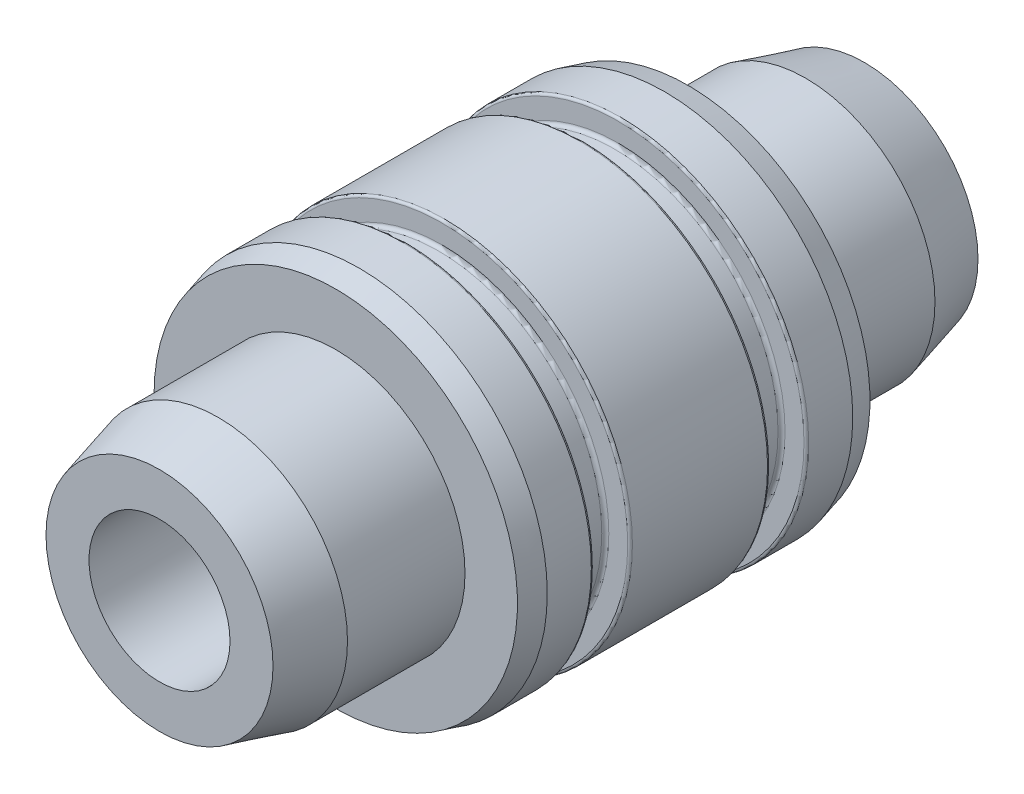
ISO-10303-21;
HEADER;
FILE_DESCRIPTION(('STEP AP214'),'2;1');
FILE_NAME('part.step','',(''),(''),'','','');
FILE_SCHEMA(('AUTOMOTIVE_DESIGN { 1 0 10303 214 1 1 1 1 }'));
ENDSEC;
DATA;
#1=APPLICATION_CONTEXT('core data for automotive mechanical design processes');
#2=APPLICATION_PROTOCOL_DEFINITION('international standard','automotive_design',2000,#1);
#3=PRODUCT_CONTEXT('',#1,'mechanical');
#4=PRODUCT('Part','Part','',(#3));
#5=PRODUCT_RELATED_PRODUCT_CATEGORY('part','',(#4));
#6=PRODUCT_DEFINITION_FORMATION('','',#4);
#7=PRODUCT_DEFINITION_CONTEXT('part definition',#1,'design');
#8=PRODUCT_DEFINITION('design','',#6,#7);
#9=PRODUCT_DEFINITION_SHAPE('','',#8);
#10=(LENGTH_UNIT() NAMED_UNIT(*) SI_UNIT(.MILLI.,.METRE.));
#11=(NAMED_UNIT(*) PLANE_ANGLE_UNIT() SI_UNIT($,.RADIAN.));
#12=(NAMED_UNIT(*) SI_UNIT($,.STERADIAN.) SOLID_ANGLE_UNIT());
#13=UNCERTAINTY_MEASURE_WITH_UNIT(LENGTH_MEASURE(1.E-05),#10,'distance_accuracy_value','');
#14=(GEOMETRIC_REPRESENTATION_CONTEXT(3) GLOBAL_UNCERTAINTY_ASSIGNED_CONTEXT((#13)) GLOBAL_UNIT_ASSIGNED_CONTEXT((#10,
#11,#12)) REPRESENTATION_CONTEXT('',''));
#15=CARTESIAN_POINT('',(0.,0.,0.));
#16=DIRECTION('',(0.,0.,1.));
#17=DIRECTION('',(1.,0.,0.));
#18=AXIS2_PLACEMENT_3D('',#15,#16,#17);
#19=CARTESIAN_POINT('',(0.,0.,15.));
#20=DIRECTION('',(0.,0.,-1.));
#21=DIRECTION('',(-1.,0.,0.));
#22=AXIS2_PLACEMENT_3D('',#19,#20,#21);
#23=CYLINDRICAL_SURFACE('',#22,16.);
#24=CARTESIAN_POINT('',(0.,0.,-5.75));
#25=DIRECTION('',(0.,0.,-1.));
#26=DIRECTION('',(-1.,0.,0.));
#27=AXIS2_PLACEMENT_3D('',#24,#25,#26);
#28=CIRCLE('',#27,16.);
#29=CARTESIAN_POINT('',(-16.,0.,-5.75));
#30=VERTEX_POINT('',#29);
#31=EDGE_CURVE('E46',#30,#30,#28,.F.);
#32=ORIENTED_EDGE('',*,*,#31,.T.);
#33=EDGE_LOOP('',(#32));
#34=FACE_BOUND('',#33,.T.);
#35=CARTESIAN_POINT('',(0.,0.,5.75));
#36=DIRECTION('',(0.,0.,1.));
#37=DIRECTION('',(1.,0.,0.));
#38=AXIS2_PLACEMENT_3D('',#35,#36,#37);
#39=CIRCLE('',#38,16.);
#40=CARTESIAN_POINT('',(16.,0.,5.75));
#41=VERTEX_POINT('',#40);
#42=EDGE_CURVE('E65',#41,#41,#39,.F.);
#43=ORIENTED_EDGE('',*,*,#42,.T.);
#44=EDGE_LOOP('',(#43));
#45=FACE_BOUND('',#44,.T.);
#46=ADVANCED_FACE('F39',(#34,#45),#23,.T.);
#47=CARTESIAN_POINT('',(0.,0.,-9.25));
#48=DIRECTION('',(0.,0.,1.));
#49=DIRECTION('',(1.,0.,0.));
#50=AXIS2_PLACEMENT_3D('',#47,#48,#49);
#51=CIRCLE('',#50,16.);
#52=CARTESIAN_POINT('',(16.,0.,-9.25));
#53=VERTEX_POINT('',#52);
#54=EDGE_CURVE('E50',#53,#53,#51,.F.);
#55=ORIENTED_EDGE('',*,*,#54,.T.);
#56=EDGE_LOOP('',(#55));
#57=FACE_BOUND('',#56,.T.);
#58=CARTESIAN_POINT('',(0.,0.,-12.9999999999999));
#59=DIRECTION('',(0.,0.,1.));
#60=DIRECTION('',(1.,0.,0.));
#61=AXIS2_PLACEMENT_3D('',#58,#59,#60);
#62=CIRCLE('',#61,16.);
#63=CARTESIAN_POINT('',(-16.,0.,-12.9999999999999));
#64=VERTEX_POINT('',#63);
#65=EDGE_CURVE('E98',#64,#64,#62,.F.);
#66=ORIENTED_EDGE('',*,*,#65,.F.);
#67=EDGE_LOOP('',(#66));
#68=FACE_BOUND('',#67,.T.);
#69=ADVANCED_FACE('F164',(#57,#68),#23,.T.);
#70=CARTESIAN_POINT('',(0.,0.,9.25));
#71=DIRECTION('',(0.,0.,-1.));
#72=DIRECTION('',(-1.,0.,0.));
#73=AXIS2_PLACEMENT_3D('',#70,#71,#72);
#74=CIRCLE('',#73,16.);
#75=CARTESIAN_POINT('',(-16.,0.,9.25));
#76=VERTEX_POINT('',#75);
#77=EDGE_CURVE('E62',#76,#76,#74,.F.);
#78=ORIENTED_EDGE('',*,*,#77,.T.);
#79=EDGE_LOOP('',(#78));
#80=FACE_BOUND('',#79,.T.);
#81=CARTESIAN_POINT('',(0.,0.,12.9999999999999));
#82=DIRECTION('',(0.,0.,1.));
#83=DIRECTION('',(1.,0.,0.));
#84=AXIS2_PLACEMENT_3D('',#81,#82,#83);
#85=CIRCLE('',#84,16.);
#86=CARTESIAN_POINT('',(-16.,0.,12.9999999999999));
#87=VERTEX_POINT('',#86);
#88=EDGE_CURVE('E71',#87,#87,#85,.F.);
#89=ORIENTED_EDGE('',*,*,#88,.T.);
#90=EDGE_LOOP('',(#89));
#91=FACE_BOUND('',#90,.T.);
#92=ADVANCED_FACE('F41',(#80,#91),#23,.T.);
#93=CARTESIAN_POINT('',(0.,0.,15.));
#94=DIRECTION('',(0.,0.,1.));
#95=DIRECTION('',(1.,0.,0.));
#96=AXIS2_PLACEMENT_3D('',#93,#94,#95);
#97=PLANE('',#96);
#98=CARTESIAN_POINT('',(0.,0.,15.));
#99=DIRECTION('',(0.,0.,1.));
#100=DIRECTION('',(1.,0.,0.));
#101=AXIS2_PLACEMENT_3D('',#98,#99,#100);
#102=CIRCLE('',#101,15.4641016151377);
#103=CARTESIAN_POINT('',(-15.4641016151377,0.,15.));
#104=VERTEX_POINT('',#103);
#105=EDGE_CURVE('E79',#104,#104,#102,.T.);
#106=ORIENTED_EDGE('',*,*,#105,.T.);
#107=EDGE_LOOP('',(#106));
#108=FACE_BOUND('',#107,.T.);
#109=CARTESIAN_POINT('',(0.,0.,15.));
#110=DIRECTION('',(0.,0.,1.));
#111=DIRECTION('',(1.,0.,0.));
#112=AXIS2_PLACEMENT_3D('',#109,#110,#111);
#113=CIRCLE('',#112,11.);
#114=CARTESIAN_POINT('',(11.,0.,15.));
#115=VERTEX_POINT('',#114);
#116=EDGE_CURVE('E89',#115,#115,#113,.T.);
#117=ORIENTED_EDGE('',*,*,#116,.F.);
#118=EDGE_LOOP('',(#117));
#119=FACE_BOUND('',#118,.T.);
#120=ADVANCED_FACE('F171',(#108,#119),#97,.T.);
#121=CARTESIAN_POINT('',(0.,0.,30.));
#122=DIRECTION('',(0.,0.,-1.));
#123=DIRECTION('',(-1.,0.,0.));
#124=AXIS2_PLACEMENT_3D('',#121,#122,#123);
#125=CYLINDRICAL_SURFACE('',#124,11.);
#126=CARTESIAN_POINT('',(0.,0.,24.9999999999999));
#127=DIRECTION('',(0.,0.,1.));
#128=DIRECTION('',(1.,0.,0.));
#129=AXIS2_PLACEMENT_3D('',#126,#127,#128);
#130=CIRCLE('',#129,11.);
#131=CARTESIAN_POINT('',(11.,0.,24.9999999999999));
#132=VERTEX_POINT('',#131);
#133=EDGE_CURVE('E83',#132,#132,#130,.F.);
#134=ORIENTED_EDGE('',*,*,#133,.T.);
#135=EDGE_LOOP('',(#134));
#136=FACE_BOUND('',#135,.T.);
#137=ORIENTED_EDGE('',*,*,#116,.T.);
#138=EDGE_LOOP('',(#137));
#139=FACE_BOUND('',#138,.T.);
#140=ADVANCED_FACE('F176',(#136,#139),#125,.T.);
#141=CARTESIAN_POINT('',(0.,0.,30.));
#142=DIRECTION('',(0.,0.,1.));
#143=DIRECTION('',(1.,0.,0.));
#144=AXIS2_PLACEMENT_3D('',#141,#142,#143);
#145=PLANE('',#144);
#146=CARTESIAN_POINT('',(0.,0.,30.));
#147=DIRECTION('',(0.,0.,1.));
#148=DIRECTION('',(1.,0.,0.));
#149=AXIS2_PLACEMENT_3D('',#146,#147,#148);
#150=CIRCLE('',#149,9.66025403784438);
#151=CARTESIAN_POINT('',(9.66025403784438,0.,30.));
#152=VERTEX_POINT('',#151);
#153=EDGE_CURVE('E86',#152,#152,#150,.T.);
#154=ORIENTED_EDGE('',*,*,#153,.T.);
#155=EDGE_LOOP('',(#154));
#156=FACE_BOUND('',#155,.T.);
#157=CARTESIAN_POINT('',(0.,0.,30.));
#158=DIRECTION('',(0.,0.,1.));
#159=DIRECTION('',(1.,0.,0.));
#160=AXIS2_PLACEMENT_3D('',#157,#158,#159);
#161=CIRCLE('',#160,6.);
#162=CARTESIAN_POINT('',(6.,0.,30.));
#163=VERTEX_POINT('',#162);
#164=EDGE_CURVE('E95',#163,#163,#161,.T.);
#165=ORIENTED_EDGE('',*,*,#164,.F.);
#166=EDGE_LOOP('',(#165));
#167=FACE_BOUND('',#166,.T.);
#168=ADVANCED_FACE('F193',(#156,#167),#145,.T.);
#169=CARTESIAN_POINT('',(0.,0.,-1.97056274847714));
#170=DIRECTION('',(0.,0.,1.));
#171=DIRECTION('',(1.,0.,0.));
#172=AXIS2_PLACEMENT_3D('',#169,#170,#171);
#173=CYLINDRICAL_SURFACE('',#172,6.);
#174=CARTESIAN_POINT('',(0.,0.,15.));
#175=DIRECTION('',(0.,0.,1.));
#176=DIRECTION('',(1.,0.,0.));
#177=AXIS2_PLACEMENT_3D('',#174,#175,#176);
#178=CIRCLE('',#177,6.);
#179=CARTESIAN_POINT('',(6.,0.,15.));
#180=VERTEX_POINT('',#179);
#181=EDGE_CURVE('E92',#180,#180,#178,.F.);
#182=ORIENTED_EDGE('',*,*,#181,.T.);
#183=EDGE_LOOP('',(#182));
#184=FACE_BOUND('',#183,.T.);
#185=ORIENTED_EDGE('',*,*,#164,.T.);
#186=EDGE_LOOP('',(#185));
#187=FACE_BOUND('',#186,.T.);
#188=ADVANCED_FACE('F199',(#184,#187),#173,.F.);
#189=CARTESIAN_POINT('',(0.,0.,15.));
#190=DIRECTION('',(0.,0.,1.));
#191=DIRECTION('',(1.,0.,0.));
#192=AXIS2_PLACEMENT_3D('',#189,#190,#191);
#193=PLANE('',#192);
#194=CARTESIAN_POINT('',(0.,0.,15.));
#195=DIRECTION('',(0.,0.,1.));
#196=DIRECTION('',(1.,0.,0.));
#197=AXIS2_PLACEMENT_3D('',#194,#195,#196);
#198=CIRCLE('',#197,4.);
#199=CARTESIAN_POINT('',(4.,0.,15.));
#200=VERTEX_POINT('',#199);
#201=EDGE_CURVE('E76',#200,#200,#198,.T.);
#202=ORIENTED_EDGE('',*,*,#201,.F.);
#203=EDGE_LOOP('',(#202));
#204=FACE_BOUND('',#203,.T.);
#205=ORIENTED_EDGE('',*,*,#181,.F.);
#206=EDGE_LOOP('',(#205));
#207=FACE_BOUND('',#206,.T.);
#208=ADVANCED_FACE('F205',(#204,#207),#193,.T.);
#209=CARTESIAN_POINT('',(0.,0.,30.));
#210=DIRECTION('',(0.,0.,-1.));
#211=DIRECTION('',(-1.,0.,0.));
#212=AXIS2_PLACEMENT_3D('',#209,#210,#211);
#213=CONICAL_SURFACE('',#212,9.66025403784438,0.261799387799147);
#214=ORIENTED_EDGE('',*,*,#133,.F.);
#215=EDGE_LOOP('',(#214));
#216=FACE_BOUND('',#215,.T.);
#217=ORIENTED_EDGE('',*,*,#153,.F.);
#218=EDGE_LOOP('',(#217));
#219=FACE_BOUND('',#218,.T.);
#220=ADVANCED_FACE('F186',(#216,#219),#213,.T.);
#221=CARTESIAN_POINT('',(0.,0.,15.));
#222=DIRECTION('',(0.,0.,-1.));
#223=DIRECTION('',(-1.,0.,0.));
#224=AXIS2_PLACEMENT_3D('',#221,#222,#223);
#225=CONICAL_SURFACE('',#224,15.4641016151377,0.261799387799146);
#226=CARTESIAN_POINT('',(-16.,0.,12.9999999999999));
#227=CARTESIAN_POINT('',(-15.9944177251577,0.,13.0208333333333));
#228=CARTESIAN_POINT('',(-15.9888354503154,0.,13.0416666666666));
#229=CARTESIAN_POINT('',(-15.9776709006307,0.,13.0833333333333));
#230=CARTESIAN_POINT('',(-15.9720886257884,0.,13.1041666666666));
#231=CARTESIAN_POINT('',(-15.9609240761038,0.,13.1458333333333));
#232=CARTESIAN_POINT('',(-15.9553418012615,0.,13.1666666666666));
#233=CARTESIAN_POINT('',(-15.9441772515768,0.,13.2083333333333));
#234=CARTESIAN_POINT('',(-15.9385949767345,0.,13.2291666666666));
#235=CARTESIAN_POINT('',(-15.9274304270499,0.,13.2708333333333));
#236=CARTESIAN_POINT('',(-15.9218481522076,0.,13.2916666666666));
#237=CARTESIAN_POINT('',(-15.910683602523,0.,13.3333333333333));
#238=CARTESIAN_POINT('',(-15.9051013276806,0.,13.3541666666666));
#239=CARTESIAN_POINT('',(-15.893936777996,0.,13.3958333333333));
#240=CARTESIAN_POINT('',(-15.8883545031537,0.,13.4166666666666));
#241=CARTESIAN_POINT('',(-15.8771899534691,0.,13.4583333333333));
#242=CARTESIAN_POINT('',(-15.8716076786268,0.,13.4791666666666));
#243=CARTESIAN_POINT('',(-15.8604431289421,0.,13.5208333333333));
#244=CARTESIAN_POINT('',(-15.8548608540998,0.,13.5416666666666));
#245=CARTESIAN_POINT('',(-15.8436963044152,0.,13.5833333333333));
#246=CARTESIAN_POINT('',(-15.8381140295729,0.,13.6041666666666));
#247=CARTESIAN_POINT('',(-15.8269494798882,0.,13.6458333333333));
#248=CARTESIAN_POINT('',(-15.8213672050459,0.,13.6666666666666));
#249=CARTESIAN_POINT('',(-15.8102026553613,0.,13.7083333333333));
#250=CARTESIAN_POINT('',(-15.804620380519,0.,13.7291666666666));
#251=CARTESIAN_POINT('',(-15.7934558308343,0.,13.7708333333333));
#252=CARTESIAN_POINT('',(-15.787873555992,0.,13.7916666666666));
#253=CARTESIAN_POINT('',(-15.7767090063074,0.,13.8333333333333));
#254=CARTESIAN_POINT('',(-15.7711267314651,0.,13.8541666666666));
#255=CARTESIAN_POINT('',(-15.7599621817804,0.,13.8958333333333));
#256=CARTESIAN_POINT('',(-15.7543799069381,0.,13.9166666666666));
#257=CARTESIAN_POINT('',(-15.7432153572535,0.,13.9583333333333));
#258=CARTESIAN_POINT('',(-15.7376330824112,0.,13.9791666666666));
#259=CARTESIAN_POINT('',(-15.7264685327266,0.,14.0208333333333));
#260=CARTESIAN_POINT('',(-15.7208862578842,0.,14.0416666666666));
#261=CARTESIAN_POINT('',(-15.7097217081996,0.,14.0833333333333));
#262=CARTESIAN_POINT('',(-15.7041394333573,0.,14.1041666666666));
#263=CARTESIAN_POINT('',(-15.6929748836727,0.,14.1458333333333));
#264=CARTESIAN_POINT('',(-15.6873926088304,0.,14.1666666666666));
#265=CARTESIAN_POINT('',(-15.6762280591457,0.,14.2083333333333));
#266=CARTESIAN_POINT('',(-15.6706457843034,0.,14.2291666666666));
#267=CARTESIAN_POINT('',(-15.6594812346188,0.,14.2708333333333));
#268=CARTESIAN_POINT('',(-15.6538989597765,0.,14.2916666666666));
#269=CARTESIAN_POINT('',(-15.6427344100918,0.,14.3333333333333));
#270=CARTESIAN_POINT('',(-15.6371521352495,0.,14.3541666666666));
#271=CARTESIAN_POINT('',(-15.6259875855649,0.,14.3958333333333));
#272=CARTESIAN_POINT('',(-15.6204053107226,0.,14.4166666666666));
#273=CARTESIAN_POINT('',(-15.6092407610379,0.,14.4583333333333));
#274=CARTESIAN_POINT('',(-15.6036584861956,0.,14.4791666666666));
#275=CARTESIAN_POINT('',(-15.592493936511,0.,14.5208333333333));
#276=CARTESIAN_POINT('',(-15.5869116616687,0.,14.5416666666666));
#277=CARTESIAN_POINT('',(-15.575747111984,0.,14.5833333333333));
#278=CARTESIAN_POINT('',(-15.5701648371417,0.,14.6041666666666));
#279=CARTESIAN_POINT('',(-15.5590002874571,0.,14.6458333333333));
#280=CARTESIAN_POINT('',(-15.5534180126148,0.,14.6666666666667));
#281=CARTESIAN_POINT('',(-15.5422534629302,0.,14.7083333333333));
#282=CARTESIAN_POINT('',(-15.5366711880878,0.,14.7291666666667));
#283=CARTESIAN_POINT('',(-15.5255066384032,0.,14.7708333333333));
#284=CARTESIAN_POINT('',(-15.5199243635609,0.,14.7916666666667));
#285=CARTESIAN_POINT('',(-15.5087598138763,0.,14.8333333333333));
#286=CARTESIAN_POINT('',(-15.5031775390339,0.,14.8541666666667));
#287=CARTESIAN_POINT('',(-15.4920129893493,0.,14.8958333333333));
#288=CARTESIAN_POINT('',(-15.486430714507,0.,14.9166666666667));
#289=CARTESIAN_POINT('',(-15.4752661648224,0.,14.9583333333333));
#290=CARTESIAN_POINT('',(-15.4696838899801,0.,14.9791666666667));
#291=CARTESIAN_POINT('',(-15.4641016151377,0.,15.));
#292=B_SPLINE_CURVE_WITH_KNOTS('',3,(#226,#227,#228,#229,#230,#231,#232,#233,#234,#235,#236,
#237,#238,#239,#240,#241,#242,#243,#244,#245,#246,#247,#248,#249,#250,#251,#252,#253,#254,#255,
#256,#257,#258,#259,#260,#261,#262,#263,#264,#265,#266,#267,#268,#269,#270,#271,#272,#273,#274,
#275,#276,#277,#278,#279,#280,#281,#282,#283,#284,#285,#286,#287,#288,#289,#290,#291),
.UNSPECIFIED.,.F.,.F.,(4,2,2,2,2,2,2,2,2,2,2,2,2,2,2,2,2,2,2,2,2,2,2,2,2,2,2,2,2,2,2,2,4),(0.,
0.0647047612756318,0.129409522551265,0.194114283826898,0.258819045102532,0.323523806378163,
0.388228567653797,0.452933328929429,0.517638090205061,0.582342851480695,0.647047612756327,
0.711752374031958,0.776457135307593,0.841161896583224,0.905866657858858,0.97057141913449,
1.03527618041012,1.09998094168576,1.16468570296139,1.22939046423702,1.29409522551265,
1.35879998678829,1.42350474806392,1.48820950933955,1.55291427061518,1.61761903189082,
1.68232379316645,1.74702855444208,1.81173331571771,1.87643807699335,1.94114283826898,
2.00584759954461,2.07055236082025),.UNSPECIFIED.);
#293=EDGE_CURVE('BSEAM182',#87,#104,#292,.T.);
#294=ORIENTED_EDGE('',*,*,#88,.F.);
#295=ORIENTED_EDGE('',*,*,#105,.F.);
#296=ORIENTED_EDGE('',*,*,#293,.T.);
#297=ORIENTED_EDGE('',*,*,#293,.F.);
#298=EDGE_LOOP('',(#294,#296,#295,#297));
#299=FACE_BOUND('',#298,.T.);
#300=ADVANCED_FACE('F182',(#299),#225,.T.);
#301=CARTESIAN_POINT('',(0.,0.,-15.));
#302=DIRECTION('',(0.,0.,-1.));
#303=DIRECTION('',(1.,0.,0.));
#304=AXIS2_PLACEMENT_3D('',#301,#302,#303);
#305=PLANE('',#304);
#306=CARTESIAN_POINT('',(0.,0.,-15.));
#307=DIRECTION('',(0.,0.,1.));
#308=DIRECTION('',(1.,0.,0.));
#309=AXIS2_PLACEMENT_3D('',#306,#307,#308);
#310=CIRCLE('',#309,15.4641016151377);
#311=CARTESIAN_POINT('',(-15.4641016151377,0.,-15.));
#312=VERTEX_POINT('',#311);
#313=EDGE_CURVE('E100',#312,#312,#310,.T.);
#314=ORIENTED_EDGE('',*,*,#313,.F.);
#315=EDGE_LOOP('',(#314));
#316=FACE_BOUND('',#315,.T.);
#317=CARTESIAN_POINT('',(0.,0.,-15.));
#318=DIRECTION('',(0.,0.,1.));
#319=DIRECTION('',(1.,0.,0.));
#320=AXIS2_PLACEMENT_3D('',#317,#318,#319);
#321=CIRCLE('',#320,11.);
#322=CARTESIAN_POINT('',(11.,0.,-15.));
#323=VERTEX_POINT('',#322);
#324=EDGE_CURVE('E111',#323,#323,#321,.T.);
#325=ORIENTED_EDGE('',*,*,#324,.T.);
#326=EDGE_LOOP('',(#325));
#327=FACE_BOUND('',#326,.T.);
#328=ADVANCED_FACE('F185',(#316,#327),#305,.T.);
#329=CARTESIAN_POINT('',(0.,0.,-30.));
#330=DIRECTION('',(0.,0.,1.));
#331=DIRECTION('',(-1.,0.,0.));
#332=AXIS2_PLACEMENT_3D('',#329,#330,#331);
#333=CYLINDRICAL_SURFACE('',#332,11.);
#334=CARTESIAN_POINT('',(0.,0.,-24.9999999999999));
#335=DIRECTION('',(0.,0.,1.));
#336=DIRECTION('',(1.,0.,0.));
#337=AXIS2_PLACEMENT_3D('',#334,#335,#336);
#338=CIRCLE('',#337,11.);
#339=CARTESIAN_POINT('',(11.,0.,-24.9999999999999));
#340=VERTEX_POINT('',#339);
#341=EDGE_CURVE('E105',#340,#340,#338,.F.);
#342=ORIENTED_EDGE('',*,*,#341,.F.);
#343=EDGE_LOOP('',(#342));
#344=FACE_BOUND('',#343,.T.);
#345=ORIENTED_EDGE('',*,*,#324,.F.);
#346=EDGE_LOOP('',(#345));
#347=FACE_BOUND('',#346,.T.);
#348=ADVANCED_FACE('F215',(#344,#347),#333,.T.);
#349=CARTESIAN_POINT('',(0.,0.,-30.));
#350=DIRECTION('',(0.,0.,-1.));
#351=DIRECTION('',(1.,0.,0.));
#352=AXIS2_PLACEMENT_3D('',#349,#350,#351);
#353=PLANE('',#352);
#354=CARTESIAN_POINT('',(0.,0.,-30.));
#355=DIRECTION('',(0.,0.,1.));
#356=DIRECTION('',(1.,0.,0.));
#357=AXIS2_PLACEMENT_3D('',#354,#355,#356);
#358=CIRCLE('',#357,9.66025403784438);
#359=CARTESIAN_POINT('',(9.66025403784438,0.,-30.));
#360=VERTEX_POINT('',#359);
#361=EDGE_CURVE('E108',#360,#360,#358,.T.);
#362=ORIENTED_EDGE('',*,*,#361,.F.);
#363=EDGE_LOOP('',(#362));
#364=FACE_BOUND('',#363,.T.);
#365=CARTESIAN_POINT('',(0.,0.,-30.));
#366=DIRECTION('',(0.,0.,1.));
#367=DIRECTION('',(1.,0.,0.));
#368=AXIS2_PLACEMENT_3D('',#365,#366,#367);
#369=CIRCLE('',#368,6.);
#370=CARTESIAN_POINT('',(6.,0.,-30.));
#371=VERTEX_POINT('',#370);
#372=EDGE_CURVE('E75',#371,#371,#369,.T.);
#373=ORIENTED_EDGE('',*,*,#372,.T.);
#374=EDGE_LOOP('',(#373));
#375=FACE_BOUND('',#374,.T.);
#376=ADVANCED_FACE('F219',(#364,#375),#353,.T.);
#377=CARTESIAN_POINT('',(0.,0.,1.97056274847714));
#378=DIRECTION('',(0.,0.,-1.));
#379=DIRECTION('',(1.,0.,0.));
#380=AXIS2_PLACEMENT_3D('',#377,#378,#379);
#381=CYLINDRICAL_SURFACE('',#380,6.);
#382=CARTESIAN_POINT('',(0.,0.,-15.));
#383=DIRECTION('',(0.,0.,1.));
#384=DIRECTION('',(1.,0.,0.));
#385=AXIS2_PLACEMENT_3D('',#382,#383,#384);
#386=CIRCLE('',#385,6.);
#387=CARTESIAN_POINT('',(6.,0.,-15.));
#388=VERTEX_POINT('',#387);
#389=EDGE_CURVE('E114',#388,#388,#386,.F.);
#390=ORIENTED_EDGE('',*,*,#389,.F.);
#391=EDGE_LOOP('',(#390));
#392=FACE_BOUND('',#391,.T.);
#393=ORIENTED_EDGE('',*,*,#372,.F.);
#394=EDGE_LOOP('',(#393));
#395=FACE_BOUND('',#394,.T.);
#396=ADVANCED_FACE('F223',(#392,#395),#381,.F.);
#397=CARTESIAN_POINT('',(0.,0.,-15.));
#398=DIRECTION('',(0.,0.,-1.));
#399=DIRECTION('',(1.,0.,0.));
#400=AXIS2_PLACEMENT_3D('',#397,#398,#399);
#401=PLANE('',#400);
#402=CARTESIAN_POINT('',(0.,0.,-15.));
#403=DIRECTION('',(0.,0.,-1.));
#404=DIRECTION('',(-1.,0.,0.));
#405=AXIS2_PLACEMENT_3D('',#402,#403,#404);
#406=CIRCLE('',#405,3.99999999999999);
#407=CARTESIAN_POINT('',(-3.99999999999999,0.,-15.));
#408=VERTEX_POINT('',#407);
#409=EDGE_CURVE('E72',#408,#408,#406,.T.);
#410=ORIENTED_EDGE('',*,*,#409,.F.);
#411=EDGE_LOOP('',(#410));
#412=FACE_BOUND('',#411,.T.);
#413=ORIENTED_EDGE('',*,*,#389,.T.);
#414=EDGE_LOOP('',(#413));
#415=FACE_BOUND('',#414,.T.);
#416=ADVANCED_FACE('F227',(#412,#415),#401,.T.);
#417=CARTESIAN_POINT('',(0.,0.,-30.));
#418=DIRECTION('',(0.,0.,1.));
#419=DIRECTION('',(-1.,0.,0.));
#420=AXIS2_PLACEMENT_3D('',#417,#418,#419);
#421=CONICAL_SURFACE('',#420,9.66025403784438,0.261799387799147);
#422=ORIENTED_EDGE('',*,*,#341,.T.);
#423=EDGE_LOOP('',(#422));
#424=FACE_BOUND('',#423,.T.);
#425=ORIENTED_EDGE('',*,*,#361,.T.);
#426=EDGE_LOOP('',(#425));
#427=FACE_BOUND('',#426,.T.);
#428=ADVANCED_FACE('F231',(#424,#427),#421,.T.);
#429=CARTESIAN_POINT('',(0.,0.,-15.));
#430=DIRECTION('',(0.,0.,1.));
#431=DIRECTION('',(-1.,0.,0.));
#432=AXIS2_PLACEMENT_3D('',#429,#430,#431);
#433=CONICAL_SURFACE('',#432,15.4641016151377,0.261799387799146);
#434=CARTESIAN_POINT('',(-16.,0.,-12.9999999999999));
#435=CARTESIAN_POINT('',(-15.9944177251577,0.,-13.0208333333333));
#436=CARTESIAN_POINT('',(-15.9888354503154,0.,-13.0416666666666));
#437=CARTESIAN_POINT('',(-15.9776709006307,0.,-13.0833333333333));
#438=CARTESIAN_POINT('',(-15.9720886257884,0.,-13.1041666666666));
#439=CARTESIAN_POINT('',(-15.9609240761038,0.,-13.1458333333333));
#440=CARTESIAN_POINT('',(-15.9553418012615,0.,-13.1666666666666));
#441=CARTESIAN_POINT('',(-15.9441772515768,0.,-13.2083333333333));
#442=CARTESIAN_POINT('',(-15.9385949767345,0.,-13.2291666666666));
#443=CARTESIAN_POINT('',(-15.9274304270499,0.,-13.2708333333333));
#444=CARTESIAN_POINT('',(-15.9218481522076,0.,-13.2916666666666));
#445=CARTESIAN_POINT('',(-15.910683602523,0.,-13.3333333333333));
#446=CARTESIAN_POINT('',(-15.9051013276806,0.,-13.3541666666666));
#447=CARTESIAN_POINT('',(-15.893936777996,0.,-13.3958333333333));
#448=CARTESIAN_POINT('',(-15.8883545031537,0.,-13.4166666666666));
#449=CARTESIAN_POINT('',(-15.8771899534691,0.,-13.4583333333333));
#450=CARTESIAN_POINT('',(-15.8716076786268,0.,-13.4791666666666));
#451=CARTESIAN_POINT('',(-15.8604431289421,0.,-13.5208333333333));
#452=CARTESIAN_POINT('',(-15.8548608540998,0.,-13.5416666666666));
#453=CARTESIAN_POINT('',(-15.8436963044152,0.,-13.5833333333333));
#454=CARTESIAN_POINT('',(-15.8381140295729,0.,-13.6041666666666));
#455=CARTESIAN_POINT('',(-15.8269494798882,0.,-13.6458333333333));
#456=CARTESIAN_POINT('',(-15.8213672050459,0.,-13.6666666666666));
#457=CARTESIAN_POINT('',(-15.8102026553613,0.,-13.7083333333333));
#458=CARTESIAN_POINT('',(-15.804620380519,0.,-13.7291666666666));
#459=CARTESIAN_POINT('',(-15.7934558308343,0.,-13.7708333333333));
#460=CARTESIAN_POINT('',(-15.787873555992,0.,-13.7916666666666));
#461=CARTESIAN_POINT('',(-15.7767090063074,0.,-13.8333333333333));
#462=CARTESIAN_POINT('',(-15.7711267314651,0.,-13.8541666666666));
#463=CARTESIAN_POINT('',(-15.7599621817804,0.,-13.8958333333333));
#464=CARTESIAN_POINT('',(-15.7543799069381,0.,-13.9166666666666));
#465=CARTESIAN_POINT('',(-15.7432153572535,0.,-13.9583333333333));
#466=CARTESIAN_POINT('',(-15.7376330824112,0.,-13.9791666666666));
#467=CARTESIAN_POINT('',(-15.7264685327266,0.,-14.0208333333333));
#468=CARTESIAN_POINT('',(-15.7208862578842,0.,-14.0416666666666));
#469=CARTESIAN_POINT('',(-15.7097217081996,0.,-14.0833333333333));
#470=CARTESIAN_POINT('',(-15.7041394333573,0.,-14.1041666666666));
#471=CARTESIAN_POINT('',(-15.6929748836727,0.,-14.1458333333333));
#472=CARTESIAN_POINT('',(-15.6873926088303,0.,-14.1666666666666));
#473=CARTESIAN_POINT('',(-15.6762280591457,0.,-14.2083333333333));
#474=CARTESIAN_POINT('',(-15.6706457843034,0.,-14.2291666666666));
#475=CARTESIAN_POINT('',(-15.6594812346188,0.,-14.2708333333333));
#476=CARTESIAN_POINT('',(-15.6538989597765,0.,-14.2916666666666));
#477=CARTESIAN_POINT('',(-15.6427344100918,0.,-14.3333333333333));
#478=CARTESIAN_POINT('',(-15.6371521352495,0.,-14.3541666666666));
#479=CARTESIAN_POINT('',(-15.6259875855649,0.,-14.3958333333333));
#480=CARTESIAN_POINT('',(-15.6204053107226,0.,-14.4166666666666));
#481=CARTESIAN_POINT('',(-15.6092407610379,0.,-14.4583333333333));
#482=CARTESIAN_POINT('',(-15.6036584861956,0.,-14.4791666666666));
#483=CARTESIAN_POINT('',(-15.592493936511,0.,-14.5208333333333));
#484=CARTESIAN_POINT('',(-15.5869116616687,0.,-14.5416666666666));
#485=CARTESIAN_POINT('',(-15.575747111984,0.,-14.5833333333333));
#486=CARTESIAN_POINT('',(-15.5701648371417,0.,-14.6041666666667));
#487=CARTESIAN_POINT('',(-15.5590002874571,0.,-14.6458333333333));
#488=CARTESIAN_POINT('',(-15.5534180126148,0.,-14.6666666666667));
#489=CARTESIAN_POINT('',(-15.5422534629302,0.,-14.7083333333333));
#490=CARTESIAN_POINT('',(-15.5366711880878,0.,-14.7291666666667));
#491=CARTESIAN_POINT('',(-15.5255066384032,0.,-14.7708333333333));
#492=CARTESIAN_POINT('',(-15.5199243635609,0.,-14.7916666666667));
#493=CARTESIAN_POINT('',(-15.5087598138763,0.,-14.8333333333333));
#494=CARTESIAN_POINT('',(-15.5031775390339,0.,-14.8541666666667));
#495=CARTESIAN_POINT('',(-15.4920129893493,0.,-14.8958333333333));
#496=CARTESIAN_POINT('',(-15.486430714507,0.,-14.9166666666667));
#497=CARTESIAN_POINT('',(-15.4752661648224,0.,-14.9583333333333));
#498=CARTESIAN_POINT('',(-15.4696838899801,0.,-14.9791666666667));
#499=CARTESIAN_POINT('',(-15.4641016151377,0.,-15.));
#500=B_SPLINE_CURVE_WITH_KNOTS('',3,(#434,#435,#436,#437,#438,#439,#440,#441,#442,#443,#444,
#445,#446,#447,#448,#449,#450,#451,#452,#453,#454,#455,#456,#457,#458,#459,#460,#461,#462,#463,
#464,#465,#466,#467,#468,#469,#470,#471,#472,#473,#474,#475,#476,#477,#478,#479,#480,#481,#482,
#483,#484,#485,#486,#487,#488,#489,#490,#491,#492,#493,#494,#495,#496,#497,#498,#499),
.UNSPECIFIED.,.F.,.F.,(4,2,2,2,2,2,2,2,2,2,2,2,2,2,2,2,2,2,2,2,2,2,2,2,2,2,2,2,2,2,2,2,4),(0.,
0.0647047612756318,0.129409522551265,0.194114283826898,0.25881904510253,0.323523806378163,
0.388228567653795,0.452933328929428,0.517638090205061,0.582342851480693,0.647047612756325,
0.711752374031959,0.776457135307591,0.841161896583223,0.905866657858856,0.970571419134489,
1.03527618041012,1.09998094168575,1.16468570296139,1.22939046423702,1.29409522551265,
1.35879998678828,1.42350474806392,1.48820950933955,1.55291427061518,1.61761903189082,
1.68232379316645,1.74702855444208,1.81173331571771,1.87643807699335,1.94114283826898,
2.00584759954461,2.07055236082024),.UNSPECIFIED.);
#501=EDGE_CURVE('BSEAM235',#64,#312,#500,.T.);
#502=ORIENTED_EDGE('',*,*,#65,.T.);
#503=ORIENTED_EDGE('',*,*,#313,.T.);
#504=ORIENTED_EDGE('',*,*,#501,.T.);
#505=ORIENTED_EDGE('',*,*,#501,.F.);
#506=EDGE_LOOP('',(#502,#504,#503,#505));
#507=FACE_BOUND('',#506,.T.);
#508=ADVANCED_FACE('F235',(#507),#433,.T.);
#509=CARTESIAN_POINT('',(0.,0.,15.));
#510=DIRECTION('',(0.,0.,1.));
#511=DIRECTION('',(1.,0.,0.));
#512=AXIS2_PLACEMENT_3D('',#509,#510,#511);
#513=CYLINDRICAL_SURFACE('',#512,3.99999999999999);
#514=ORIENTED_EDGE('',*,*,#409,.T.);
#515=EDGE_LOOP('',(#514));
#516=FACE_BOUND('',#515,.T.);
#517=ORIENTED_EDGE('',*,*,#201,.T.);
#518=EDGE_LOOP('',(#517));
#519=FACE_BOUND('',#518,.T.);
#520=ADVANCED_FACE('F239',(#516,#519),#513,.F.);
#521=CARTESIAN_POINT('',(0.,16.,9.05));
#522=DIRECTION('',(0.,0.,-1.));
#523=DIRECTION('',(-1.,0.,0.));
#524=AXIS2_PLACEMENT_3D('',#521,#522,#523);
#525=PLANE('',#524);
#526=CARTESIAN_POINT('',(0.,0.,9.05));
#527=DIRECTION('',(0.,0.,-1.));
#528=DIRECTION('',(-1.,0.,0.));
#529=AXIS2_PLACEMENT_3D('',#526,#527,#528);
#530=CIRCLE('',#529,15.8);
#531=CARTESIAN_POINT('',(-15.8,0.,9.05));
#532=VERTEX_POINT('',#531);
#533=EDGE_CURVE('E59',#532,#532,#530,.T.);
#534=ORIENTED_EDGE('',*,*,#533,.T.);
#535=EDGE_LOOP('',(#534));
#536=FACE_BOUND('',#535,.T.);
#537=CARTESIAN_POINT('',(0.,0.,9.05));
#538=DIRECTION('',(0.,0.,1.));
#539=DIRECTION('',(1.,0.,0.));
#540=AXIS2_PLACEMENT_3D('',#537,#538,#539);
#541=CIRCLE('',#540,14.19);
#542=CARTESIAN_POINT('',(14.19,0.,9.05));
#543=VERTEX_POINT('',#542);
#544=EDGE_CURVE('E121',#543,#543,#541,.T.);
#545=ORIENTED_EDGE('',*,*,#544,.T.);
#546=EDGE_LOOP('',(#545));
#547=FACE_BOUND('',#546,.T.);
#548=ADVANCED_FACE('F243',(#536,#547),#525,.T.);
#549=CARTESIAN_POINT('',(0.,0.,8.75));
#550=DIRECTION('',(0.,0.,1.));
#551=DIRECTION('',(1.,0.,0.));
#552=AXIS2_PLACEMENT_3D('',#549,#550,#551);
#553=TOROIDAL_SURFACE('',#552,14.19,0.3);
#554=CARTESIAN_POINT('',(0.,0.,8.75));
#555=DIRECTION('',(0.,0.,1.));
#556=DIRECTION('',(1.,0.,0.));
#557=AXIS2_PLACEMENT_3D('',#554,#555,#556);
#558=CIRCLE('',#557,13.89);
#559=CARTESIAN_POINT('',(13.89,0.,8.75));
#560=VERTEX_POINT('',#559);
#561=EDGE_CURVE('E124',#560,#560,#558,.T.);
#562=ORIENTED_EDGE('',*,*,#561,.T.);
#563=EDGE_LOOP('',(#562));
#564=FACE_BOUND('',#563,.T.);
#565=ORIENTED_EDGE('',*,*,#544,.F.);
#566=EDGE_LOOP('',(#565));
#567=FACE_BOUND('',#566,.T.);
#568=ADVANCED_FACE('F247',(#564,#567),#553,.F.);
#569=CARTESIAN_POINT('',(0.,0.,16.1437416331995));
#570=DIRECTION('',(0.,0.,1.));
#571=DIRECTION('',(1.,0.,0.));
#572=AXIS2_PLACEMENT_3D('',#569,#570,#571);
#573=CYLINDRICAL_SURFACE('',#572,13.89);
#574=CARTESIAN_POINT('',(0.,0.,6.25));
#575=DIRECTION('',(0.,0.,1.));
#576=DIRECTION('',(1.,0.,0.));
#577=AXIS2_PLACEMENT_3D('',#574,#575,#576);
#578=CIRCLE('',#577,13.89);
#579=CARTESIAN_POINT('',(13.89,0.,6.25));
#580=VERTEX_POINT('',#579);
#581=EDGE_CURVE('E127',#580,#580,#578,.T.);
#582=ORIENTED_EDGE('',*,*,#581,.T.);
#583=EDGE_LOOP('',(#582));
#584=FACE_BOUND('',#583,.T.);
#585=ORIENTED_EDGE('',*,*,#561,.F.);
#586=EDGE_LOOP('',(#585));
#587=FACE_BOUND('',#586,.T.);
#588=ADVANCED_FACE('F251',(#584,#587),#573,.T.);
#589=CARTESIAN_POINT('',(0.,0.,6.25));
#590=DIRECTION('',(0.,0.,1.));
#591=DIRECTION('',(1.,0.,0.));
#592=AXIS2_PLACEMENT_3D('',#589,#590,#591);
#593=TOROIDAL_SURFACE('',#592,14.19,0.3);
#594=CARTESIAN_POINT('',(0.,0.,5.95));
#595=DIRECTION('',(0.,0.,1.));
#596=DIRECTION('',(1.,0.,0.));
#597=AXIS2_PLACEMENT_3D('',#594,#595,#596);
#598=CIRCLE('',#597,14.19);
#599=CARTESIAN_POINT('',(14.19,0.,5.95));
#600=VERTEX_POINT('',#599);
#601=EDGE_CURVE('E130',#600,#600,#598,.T.);
#602=ORIENTED_EDGE('',*,*,#601,.T.);
#603=EDGE_LOOP('',(#602));
#604=FACE_BOUND('',#603,.T.);
#605=ORIENTED_EDGE('',*,*,#581,.F.);
#606=EDGE_LOOP('',(#605));
#607=FACE_BOUND('',#606,.T.);
#608=ADVANCED_FACE('F255',(#604,#607),#593,.F.);
#609=CARTESIAN_POINT('',(0.,16.,5.95));
#610=DIRECTION('',(0.,0.,1.));
#611=DIRECTION('',(1.,0.,0.));
#612=AXIS2_PLACEMENT_3D('',#609,#610,#611);
#613=PLANE('',#612);
#614=CARTESIAN_POINT('',(0.,0.,5.95));
#615=DIRECTION('',(0.,0.,1.));
#616=DIRECTION('',(1.,0.,0.));
#617=AXIS2_PLACEMENT_3D('',#614,#615,#616);
#618=CIRCLE('',#617,15.8);
#619=CARTESIAN_POINT('',(15.8,0.,5.95));
#620=VERTEX_POINT('',#619);
#621=EDGE_CURVE('E68',#620,#620,#618,.T.);
#622=ORIENTED_EDGE('',*,*,#621,.T.);
#623=EDGE_LOOP('',(#622));
#624=FACE_BOUND('',#623,.T.);
#625=ORIENTED_EDGE('',*,*,#601,.F.);
#626=EDGE_LOOP('',(#625));
#627=FACE_BOUND('',#626,.T.);
#628=ADVANCED_FACE('F259',(#624,#627),#613,.T.);
#629=CARTESIAN_POINT('',(0.,0.,5.75));
#630=DIRECTION('',(0.,0.,1.));
#631=DIRECTION('',(1.,0.,0.));
#632=AXIS2_PLACEMENT_3D('',#629,#630,#631);
#633=TOROIDAL_SURFACE('',#632,15.8,0.2);
#634=ORIENTED_EDGE('',*,*,#42,.F.);
#635=EDGE_LOOP('',(#634));
#636=FACE_BOUND('',#635,.T.);
#637=ORIENTED_EDGE('',*,*,#621,.F.);
#638=EDGE_LOOP('',(#637));
#639=FACE_BOUND('',#638,.T.);
#640=ADVANCED_FACE('F263',(#636,#639),#633,.T.);
#641=CARTESIAN_POINT('',(0.,0.,9.25));
#642=DIRECTION('',(0.,0.,-1.));
#643=DIRECTION('',(-1.,0.,0.));
#644=AXIS2_PLACEMENT_3D('',#641,#642,#643);
#645=TOROIDAL_SURFACE('',#644,15.8,0.2);
#646=ORIENTED_EDGE('',*,*,#533,.F.);
#647=EDGE_LOOP('',(#646));
#648=FACE_BOUND('',#647,.T.);
#649=ORIENTED_EDGE('',*,*,#77,.F.);
#650=EDGE_LOOP('',(#649));
#651=FACE_BOUND('',#650,.T.);
#652=ADVANCED_FACE('F267',(#648,#651),#645,.T.);
#653=CARTESIAN_POINT('',(0.,16.,-5.95));
#654=DIRECTION('',(0.,0.,-1.));
#655=DIRECTION('',(-1.,0.,0.));
#656=AXIS2_PLACEMENT_3D('',#653,#654,#655);
#657=PLANE('',#656);
#658=CARTESIAN_POINT('',(0.,0.,-5.95));
#659=DIRECTION('',(0.,0.,-1.));
#660=DIRECTION('',(-1.,0.,0.));
#661=AXIS2_PLACEMENT_3D('',#658,#659,#660);
#662=CIRCLE('',#661,15.8);
#663=CARTESIAN_POINT('',(-15.8,0.,-5.95));
#664=VERTEX_POINT('',#663);
#665=EDGE_CURVE('E11',#664,#664,#662,.T.);
#666=ORIENTED_EDGE('',*,*,#665,.T.);
#667=EDGE_LOOP('',(#666));
#668=FACE_BOUND('',#667,.T.);
#669=CARTESIAN_POINT('',(0.,0.,-5.95));
#670=DIRECTION('',(0.,0.,1.));
#671=DIRECTION('',(1.,0.,0.));
#672=AXIS2_PLACEMENT_3D('',#669,#670,#671);
#673=CIRCLE('',#672,14.19);
#674=CARTESIAN_POINT('',(14.19,0.,-5.95));
#675=VERTEX_POINT('',#674);
#676=EDGE_CURVE('E133',#675,#675,#673,.T.);
#677=ORIENTED_EDGE('',*,*,#676,.T.);
#678=EDGE_LOOP('',(#677));
#679=FACE_BOUND('',#678,.T.);
#680=ADVANCED_FACE('F271',(#668,#679),#657,.T.);
#681=CARTESIAN_POINT('',(0.,0.,-6.25));
#682=DIRECTION('',(0.,0.,1.));
#683=DIRECTION('',(1.,0.,0.));
#684=AXIS2_PLACEMENT_3D('',#681,#682,#683);
#685=TOROIDAL_SURFACE('',#684,14.19,0.3);
#686=CARTESIAN_POINT('',(0.,0.,-6.25));
#687=DIRECTION('',(0.,0.,1.));
#688=DIRECTION('',(1.,0.,0.));
#689=AXIS2_PLACEMENT_3D('',#686,#687,#688);
#690=CIRCLE('',#689,13.89);
#691=CARTESIAN_POINT('',(13.89,0.,-6.25));
#692=VERTEX_POINT('',#691);
#693=EDGE_CURVE('E136',#692,#692,#690,.T.);
#694=ORIENTED_EDGE('',*,*,#693,.T.);
#695=EDGE_LOOP('',(#694));
#696=FACE_BOUND('',#695,.T.);
#697=ORIENTED_EDGE('',*,*,#676,.F.);
#698=EDGE_LOOP('',(#697));
#699=FACE_BOUND('',#698,.T.);
#700=ADVANCED_FACE('F275',(#696,#699),#685,.F.);
#701=CARTESIAN_POINT('',(0.,0.,1.14374163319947));
#702=DIRECTION('',(0.,0.,1.));
#703=DIRECTION('',(1.,0.,0.));
#704=AXIS2_PLACEMENT_3D('',#701,#702,#703);
#705=CYLINDRICAL_SURFACE('',#704,13.89);
#706=CARTESIAN_POINT('',(0.,0.,-8.75));
#707=DIRECTION('',(0.,0.,1.));
#708=DIRECTION('',(1.,0.,0.));
#709=AXIS2_PLACEMENT_3D('',#706,#707,#708);
#710=CIRCLE('',#709,13.89);
#711=CARTESIAN_POINT('',(13.89,0.,-8.75));
#712=VERTEX_POINT('',#711);
#713=EDGE_CURVE('E139',#712,#712,#710,.T.);
#714=ORIENTED_EDGE('',*,*,#713,.T.);
#715=EDGE_LOOP('',(#714));
#716=FACE_BOUND('',#715,.T.);
#717=ORIENTED_EDGE('',*,*,#693,.F.);
#718=EDGE_LOOP('',(#717));
#719=FACE_BOUND('',#718,.T.);
#720=ADVANCED_FACE('F161',(#716,#719),#705,.T.);
#721=CARTESIAN_POINT('',(0.,0.,-8.75));
#722=DIRECTION('',(0.,0.,1.));
#723=DIRECTION('',(1.,0.,0.));
#724=AXIS2_PLACEMENT_3D('',#721,#722,#723);
#725=TOROIDAL_SURFACE('',#724,14.19,0.3);
#726=CARTESIAN_POINT('',(0.,0.,-9.05));
#727=DIRECTION('',(0.,0.,1.));
#728=DIRECTION('',(1.,0.,0.));
#729=AXIS2_PLACEMENT_3D('',#726,#727,#728);
#730=CIRCLE('',#729,14.19);
#731=CARTESIAN_POINT('',(14.19,0.,-9.05));
#732=VERTEX_POINT('',#731);
#733=EDGE_CURVE('E142',#732,#732,#730,.T.);
#734=ORIENTED_EDGE('',*,*,#733,.T.);
#735=EDGE_LOOP('',(#734));
#736=FACE_BOUND('',#735,.T.);
#737=ORIENTED_EDGE('',*,*,#713,.F.);
#738=EDGE_LOOP('',(#737));
#739=FACE_BOUND('',#738,.T.);
#740=ADVANCED_FACE('F146',(#736,#739),#725,.F.);
#741=CARTESIAN_POINT('',(0.,16.,-9.05));
#742=DIRECTION('',(0.,0.,1.));
#743=DIRECTION('',(1.,0.,0.));
#744=AXIS2_PLACEMENT_3D('',#741,#742,#743);
#745=PLANE('',#744);
#746=CARTESIAN_POINT('',(0.,0.,-9.05));
#747=DIRECTION('',(0.,0.,1.));
#748=DIRECTION('',(1.,0.,0.));
#749=AXIS2_PLACEMENT_3D('',#746,#747,#748);
#750=CIRCLE('',#749,15.8);
#751=CARTESIAN_POINT('',(15.8,0.,-9.05));
#752=VERTEX_POINT('',#751);
#753=EDGE_CURVE('E54',#752,#752,#750,.T.);
#754=ORIENTED_EDGE('',*,*,#753,.T.);
#755=EDGE_LOOP('',(#754));
#756=FACE_BOUND('',#755,.T.);
#757=ORIENTED_EDGE('',*,*,#733,.F.);
#758=EDGE_LOOP('',(#757));
#759=FACE_BOUND('',#758,.T.);
#760=ADVANCED_FACE('F149',(#756,#759),#745,.T.);
#761=CARTESIAN_POINT('',(0.,0.,-9.25));
#762=DIRECTION('',(0.,0.,1.));
#763=DIRECTION('',(1.,0.,0.));
#764=AXIS2_PLACEMENT_3D('',#761,#762,#763);
#765=TOROIDAL_SURFACE('',#764,15.8,0.2);
#766=ORIENTED_EDGE('',*,*,#54,.F.);
#767=EDGE_LOOP('',(#766));
#768=FACE_BOUND('',#767,.T.);
#769=ORIENTED_EDGE('',*,*,#753,.F.);
#770=EDGE_LOOP('',(#769));
#771=FACE_BOUND('',#770,.T.);
#772=ADVANCED_FACE('F151',(#768,#771),#765,.T.);
#773=CARTESIAN_POINT('',(0.,0.,-5.75));
#774=DIRECTION('',(0.,0.,-1.));
#775=DIRECTION('',(-1.,0.,0.));
#776=AXIS2_PLACEMENT_3D('',#773,#774,#775);
#777=TOROIDAL_SURFACE('',#776,15.8,0.2);
#778=ORIENTED_EDGE('',*,*,#665,.F.);
#779=EDGE_LOOP('',(#778));
#780=FACE_BOUND('',#779,.T.);
#781=ORIENTED_EDGE('',*,*,#31,.F.);
#782=EDGE_LOOP('',(#781));
#783=FACE_BOUND('',#782,.T.);
#784=ADVANCED_FACE('F158',(#780,#783),#777,.T.);
#785=CLOSED_SHELL('',(#46,#69,#92,#120,#140,#168,#188,#208,#220,#300,#328,#348,#376,#396,#416,
#428,#508,#520,#548,#568,#588,#608,#628,#640,#652,#680,#700,#720,#740,#760,#772,#784));
#786=MANIFOLD_SOLID_BREP('B2',#785);
#787=ADVANCED_BREP_SHAPE_REPRESENTATION('',(#18,#786),#14);
#788=SHAPE_DEFINITION_REPRESENTATION(#9,#787);
ENDSEC;
END-ISO-10303-21;
